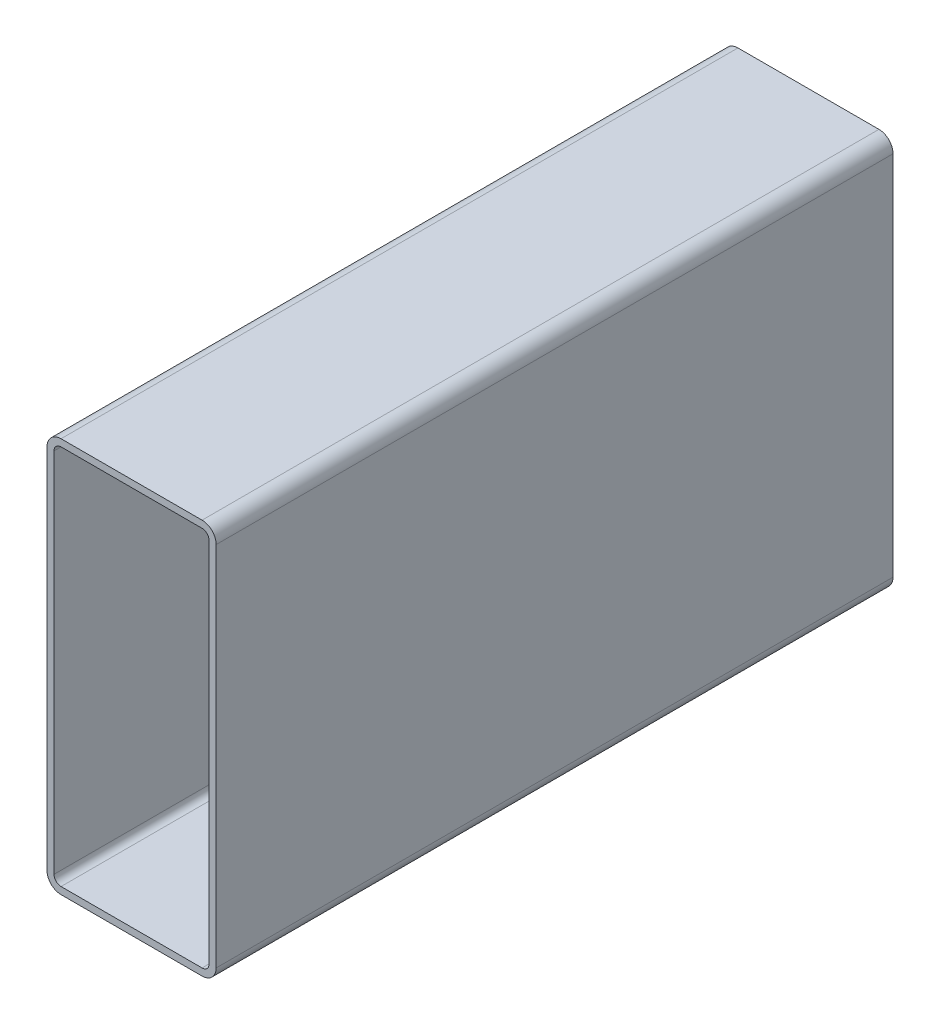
ISO-10303-21;
HEADER;
FILE_DESCRIPTION(('STEP AP214'),'2;1');
FILE_NAME('part.step','',(''),(''),'','','');
FILE_SCHEMA(('AUTOMOTIVE_DESIGN { 1 0 10303 214 1 1 1 1 }'));
ENDSEC;
DATA;
#1=APPLICATION_CONTEXT('core data for automotive mechanical design processes');
#2=APPLICATION_PROTOCOL_DEFINITION('international standard','automotive_design',2000,#1);
#3=PRODUCT_CONTEXT('',#1,'mechanical');
#4=PRODUCT('Part','Part','',(#3));
#5=PRODUCT_RELATED_PRODUCT_CATEGORY('part','',(#4));
#6=PRODUCT_DEFINITION_FORMATION('','',#4);
#7=PRODUCT_DEFINITION_CONTEXT('part definition',#1,'design');
#8=PRODUCT_DEFINITION('design','',#6,#7);
#9=PRODUCT_DEFINITION_SHAPE('','',#8);
#10=(LENGTH_UNIT() NAMED_UNIT(*) SI_UNIT(.MILLI.,.METRE.));
#11=(NAMED_UNIT(*) PLANE_ANGLE_UNIT() SI_UNIT($,.RADIAN.));
#12=(NAMED_UNIT(*) SI_UNIT($,.STERADIAN.) SOLID_ANGLE_UNIT());
#13=UNCERTAINTY_MEASURE_WITH_UNIT(LENGTH_MEASURE(1.E-05),#10,'distance_accuracy_value','');
#14=(GEOMETRIC_REPRESENTATION_CONTEXT(3) GLOBAL_UNCERTAINTY_ASSIGNED_CONTEXT((#13)) GLOBAL_UNIT_ASSIGNED_CONTEXT((#10,
#11,#12)) REPRESENTATION_CONTEXT('',''));
#15=CARTESIAN_POINT('',(0.,0.,0.));
#16=DIRECTION('',(0.,0.,1.));
#17=DIRECTION('',(1.,0.,0.));
#18=AXIS2_PLACEMENT_3D('',#15,#16,#17);
#19=CARTESIAN_POINT('',(8.83911603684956,173.439039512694,304.8));
#20=DIRECTION('',(0.,0.,1.));
#21=DIRECTION('',(1.,0.,0.));
#22=AXIS2_PLACEMENT_3D('',#19,#20,#21);
#23=PLANE('',#22);
#24=CARTESIAN_POINT('',(8.83911603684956,173.439039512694,304.8));
#25=DIRECTION('',(0.,0.,1.));
#26=DIRECTION('',(1.,0.,0.));
#27=AXIS2_PLACEMENT_3D('',#24,#25,#26);
#28=CIRCLE('',#27,6.35);
#29=CARTESIAN_POINT('',(8.83911603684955,179.789039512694,304.8));
#30=VERTEX_POINT('',#29);
#31=CARTESIAN_POINT('',(2.48911603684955,173.439039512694,304.8));
#32=VERTEX_POINT('',#31);
#33=EDGE_CURVE('E211',#30,#32,#28,.T.);
#34=ORIENTED_EDGE('',*,*,#33,.T.);
#35=DIRECTION('',(0.,-1.,0.));
#36=VECTOR('',#35,1.);
#37=CARTESIAN_POINT('',(2.48911603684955,8.33903951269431,304.8));
#38=LINE('',#37,#36);
#39=CARTESIAN_POINT('',(2.48911603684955,8.33903951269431,304.8));
#40=VERTEX_POINT('',#39);
#41=EDGE_CURVE('E214',#32,#40,#38,.T.);
#42=ORIENTED_EDGE('',*,*,#41,.T.);
#43=CARTESIAN_POINT('',(8.83911603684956,8.33903951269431,304.8));
#44=DIRECTION('',(0.,0.,1.));
#45=DIRECTION('',(1.,0.,0.));
#46=AXIS2_PLACEMENT_3D('',#43,#44,#45);
#47=CIRCLE('',#46,6.35);
#48=CARTESIAN_POINT('',(8.83911603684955,1.98903951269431,304.8));
#49=VERTEX_POINT('',#48);
#50=EDGE_CURVE('E217',#40,#49,#47,.T.);
#51=ORIENTED_EDGE('',*,*,#50,.T.);
#52=DIRECTION('',(1.,0.,0.));
#53=VECTOR('',#52,1.);
#54=CARTESIAN_POINT('',(72.3391160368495,1.98903951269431,304.8));
#55=LINE('',#54,#53);
#56=CARTESIAN_POINT('',(72.3391160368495,1.98903951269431,304.8));
#57=VERTEX_POINT('',#56);
#58=EDGE_CURVE('E219',#49,#57,#55,.T.);
#59=ORIENTED_EDGE('',*,*,#58,.T.);
#60=CARTESIAN_POINT('',(72.3391160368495,8.3390395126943,304.8));
#61=DIRECTION('',(0.,0.,1.));
#62=DIRECTION('',(1.,0.,0.));
#63=AXIS2_PLACEMENT_3D('',#60,#61,#62);
#64=CIRCLE('',#63,6.34999999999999);
#65=CARTESIAN_POINT('',(78.6891160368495,8.33903951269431,304.8));
#66=VERTEX_POINT('',#65);
#67=EDGE_CURVE('E221',#57,#66,#64,.T.);
#68=ORIENTED_EDGE('',*,*,#67,.T.);
#69=DIRECTION('',(0.,1.,0.));
#70=VECTOR('',#69,1.);
#71=CARTESIAN_POINT('',(78.6891160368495,173.439039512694,304.8));
#72=LINE('',#71,#70);
#73=CARTESIAN_POINT('',(78.6891160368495,173.439039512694,304.8));
#74=VERTEX_POINT('',#73);
#75=EDGE_CURVE('E223',#66,#74,#72,.T.);
#76=ORIENTED_EDGE('',*,*,#75,.T.);
#77=CARTESIAN_POINT('',(72.3391160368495,173.439039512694,304.8));
#78=DIRECTION('',(0.,0.,1.));
#79=DIRECTION('',(1.,0.,0.));
#80=AXIS2_PLACEMENT_3D('',#77,#78,#79);
#81=CIRCLE('',#80,6.34999999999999);
#82=CARTESIAN_POINT('',(72.3391160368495,179.789039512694,304.8));
#83=VERTEX_POINT('',#82);
#84=EDGE_CURVE('E225',#74,#83,#81,.T.);
#85=ORIENTED_EDGE('',*,*,#84,.T.);
#86=DIRECTION('',(-1.,0.,0.));
#87=VECTOR('',#86,1.);
#88=CARTESIAN_POINT('',(8.83911603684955,179.789039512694,304.8));
#89=LINE('',#88,#87);
#90=EDGE_CURVE('E227',#83,#30,#89,.T.);
#91=ORIENTED_EDGE('',*,*,#90,.T.);
#92=EDGE_LOOP('',(#34,#42,#51,#59,#68,#76,#85,#91));
#93=FACE_BOUND('',#92,.T.);
#94=DIRECTION('',(0.,-1.,0.));
#95=VECTOR('',#94,1.);
#96=CARTESIAN_POINT('',(5.66411603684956,8.33903951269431,304.8));
#97=LINE('',#96,#95);
#98=CARTESIAN_POINT('',(5.66411603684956,173.439039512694,304.8));
#99=VERTEX_POINT('',#98);
#100=CARTESIAN_POINT('',(5.66411603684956,8.33903951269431,304.8));
#101=VERTEX_POINT('',#100);
#102=EDGE_CURVE('E154',#99,#101,#97,.T.);
#103=ORIENTED_EDGE('',*,*,#102,.F.);
#104=CARTESIAN_POINT('',(8.83911603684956,173.439039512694,304.8));
#105=DIRECTION('',(0.,0.,1.));
#106=DIRECTION('',(1.,0.,0.));
#107=AXIS2_PLACEMENT_3D('',#104,#105,#106);
#108=CIRCLE('',#107,3.17500000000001);
#109=CARTESIAN_POINT('',(8.83911603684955,176.614039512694,304.8));
#110=VERTEX_POINT('',#109);
#111=EDGE_CURVE('E146',#110,#99,#108,.T.);
#112=ORIENTED_EDGE('',*,*,#111,.F.);
#113=DIRECTION('',(-1.,0.,0.));
#114=VECTOR('',#113,1.);
#115=CARTESIAN_POINT('',(8.83911603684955,176.614039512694,304.8));
#116=LINE('',#115,#114);
#117=CARTESIAN_POINT('',(72.3391160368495,176.614039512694,304.8));
#118=VERTEX_POINT('',#117);
#119=EDGE_CURVE('E179',#118,#110,#116,.T.);
#120=ORIENTED_EDGE('',*,*,#119,.F.);
#121=CARTESIAN_POINT('',(72.3391160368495,173.439039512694,304.8));
#122=DIRECTION('',(0.,0.,1.));
#123=DIRECTION('',(1.,0.,0.));
#124=AXIS2_PLACEMENT_3D('',#121,#122,#123);
#125=CIRCLE('',#124,3.17500000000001);
#126=CARTESIAN_POINT('',(75.5141160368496,173.439039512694,304.8));
#127=VERTEX_POINT('',#126);
#128=EDGE_CURVE('E177',#127,#118,#125,.T.);
#129=ORIENTED_EDGE('',*,*,#128,.F.);
#130=DIRECTION('',(0.,1.,0.));
#131=VECTOR('',#130,1.);
#132=CARTESIAN_POINT('',(75.5141160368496,173.439039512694,304.8));
#133=LINE('',#132,#131);
#134=CARTESIAN_POINT('',(75.5141160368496,8.33903951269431,304.8));
#135=VERTEX_POINT('',#134);
#136=EDGE_CURVE('E175',#135,#127,#133,.T.);
#137=ORIENTED_EDGE('',*,*,#136,.F.);
#138=CARTESIAN_POINT('',(72.3391160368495,8.3390395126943,304.8));
#139=DIRECTION('',(0.,0.,1.));
#140=DIRECTION('',(1.,0.,0.));
#141=AXIS2_PLACEMENT_3D('',#138,#139,#140);
#142=CIRCLE('',#141,3.175);
#143=CARTESIAN_POINT('',(72.3391160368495,5.1640395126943,304.8));
#144=VERTEX_POINT('',#143);
#145=EDGE_CURVE('E173',#144,#135,#142,.T.);
#146=ORIENTED_EDGE('',*,*,#145,.F.);
#147=DIRECTION('',(1.,0.,0.));
#148=VECTOR('',#147,1.);
#149=CARTESIAN_POINT('',(72.3391160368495,5.16403951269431,304.8));
#150=LINE('',#149,#148);
#151=CARTESIAN_POINT('',(8.83911603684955,5.16403951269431,304.8));
#152=VERTEX_POINT('',#151);
#153=EDGE_CURVE('E169',#152,#144,#150,.T.);
#154=ORIENTED_EDGE('',*,*,#153,.F.);
#155=CARTESIAN_POINT('',(8.83911603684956,8.33903951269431,304.8));
#156=DIRECTION('',(0.,0.,1.));
#157=DIRECTION('',(1.,0.,0.));
#158=AXIS2_PLACEMENT_3D('',#155,#156,#157);
#159=CIRCLE('',#158,3.175);
#160=EDGE_CURVE('E167',#101,#152,#159,.T.);
#161=ORIENTED_EDGE('',*,*,#160,.F.);
#162=EDGE_LOOP('',(#103,#112,#120,#129,#137,#146,#154,#161));
#163=FACE_BOUND('',#162,.T.);
#164=ADVANCED_FACE('F33',(#93,#163),#23,.T.);
#165=CARTESIAN_POINT('',(8.83911603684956,173.439039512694,0.));
#166=DIRECTION('',(0.,0.,1.));
#167=DIRECTION('',(1.,0.,0.));
#168=AXIS2_PLACEMENT_3D('',#165,#166,#167);
#169=PLANE('',#168);
#170=CARTESIAN_POINT('',(8.83911603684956,173.439039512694,0.));
#171=DIRECTION('',(0.,0.,1.));
#172=DIRECTION('',(1.,0.,0.));
#173=AXIS2_PLACEMENT_3D('',#170,#171,#172);
#174=CIRCLE('',#173,6.35);
#175=CARTESIAN_POINT('',(8.83911603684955,179.789039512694,0.));
#176=VERTEX_POINT('',#175);
#177=CARTESIAN_POINT('',(2.48911603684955,173.439039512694,0.));
#178=VERTEX_POINT('',#177);
#179=EDGE_CURVE('E162',#176,#178,#174,.T.);
#180=ORIENTED_EDGE('',*,*,#179,.F.);
#181=DIRECTION('',(-1.,0.,0.));
#182=VECTOR('',#181,1.);
#183=CARTESIAN_POINT('',(8.83911603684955,179.789039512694,0.));
#184=LINE('',#183,#182);
#185=CARTESIAN_POINT('',(72.3391160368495,179.789039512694,0.));
#186=VERTEX_POINT('',#185);
#187=EDGE_CURVE('E215',#186,#176,#184,.T.);
#188=ORIENTED_EDGE('',*,*,#187,.F.);
#189=CARTESIAN_POINT('',(72.3391160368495,173.439039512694,0.));
#190=DIRECTION('',(0.,0.,1.));
#191=DIRECTION('',(1.,0.,0.));
#192=AXIS2_PLACEMENT_3D('',#189,#190,#191);
#193=CIRCLE('',#192,6.34999999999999);
#194=CARTESIAN_POINT('',(78.6891160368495,173.439039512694,0.));
#195=VERTEX_POINT('',#194);
#196=EDGE_CURVE('E242',#195,#186,#193,.T.);
#197=ORIENTED_EDGE('',*,*,#196,.F.);
#198=DIRECTION('',(0.,1.,0.));
#199=VECTOR('',#198,1.);
#200=CARTESIAN_POINT('',(78.6891160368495,173.439039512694,0.));
#201=LINE('',#200,#199);
#202=CARTESIAN_POINT('',(78.6891160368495,8.33903951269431,0.));
#203=VERTEX_POINT('',#202);
#204=EDGE_CURVE('E240',#203,#195,#201,.T.);
#205=ORIENTED_EDGE('',*,*,#204,.F.);
#206=CARTESIAN_POINT('',(72.3391160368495,8.3390395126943,0.));
#207=DIRECTION('',(0.,0.,1.));
#208=DIRECTION('',(1.,0.,0.));
#209=AXIS2_PLACEMENT_3D('',#206,#207,#208);
#210=CIRCLE('',#209,6.34999999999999);
#211=CARTESIAN_POINT('',(72.3391160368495,1.98903951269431,0.));
#212=VERTEX_POINT('',#211);
#213=EDGE_CURVE('E238',#212,#203,#210,.T.);
#214=ORIENTED_EDGE('',*,*,#213,.F.);
#215=DIRECTION('',(1.,0.,0.));
#216=VECTOR('',#215,1.);
#217=CARTESIAN_POINT('',(72.3391160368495,1.98903951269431,0.));
#218=LINE('',#217,#216);
#219=CARTESIAN_POINT('',(8.83911603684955,1.98903951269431,0.));
#220=VERTEX_POINT('',#219);
#221=EDGE_CURVE('E236',#220,#212,#218,.T.);
#222=ORIENTED_EDGE('',*,*,#221,.F.);
#223=CARTESIAN_POINT('',(8.83911603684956,8.33903951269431,0.));
#224=DIRECTION('',(0.,0.,1.));
#225=DIRECTION('',(1.,0.,0.));
#226=AXIS2_PLACEMENT_3D('',#223,#224,#225);
#227=CIRCLE('',#226,6.35);
#228=CARTESIAN_POINT('',(2.48911603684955,8.33903951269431,0.));
#229=VERTEX_POINT('',#228);
#230=EDGE_CURVE('E234',#229,#220,#227,.T.);
#231=ORIENTED_EDGE('',*,*,#230,.F.);
#232=DIRECTION('',(0.,-1.,0.));
#233=VECTOR('',#232,1.);
#234=CARTESIAN_POINT('',(2.48911603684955,8.33903951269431,0.));
#235=LINE('',#234,#233);
#236=EDGE_CURVE('E232',#178,#229,#235,.T.);
#237=ORIENTED_EDGE('',*,*,#236,.F.);
#238=EDGE_LOOP('',(#180,#188,#197,#205,#214,#222,#231,#237));
#239=FACE_BOUND('',#238,.T.);
#240=CARTESIAN_POINT('',(8.83911603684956,173.439039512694,0.));
#241=DIRECTION('',(0.,0.,1.));
#242=DIRECTION('',(1.,0.,0.));
#243=AXIS2_PLACEMENT_3D('',#240,#241,#242);
#244=CIRCLE('',#243,3.17500000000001);
#245=CARTESIAN_POINT('',(8.83911603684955,176.614039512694,0.));
#246=VERTEX_POINT('',#245);
#247=CARTESIAN_POINT('',(5.66411603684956,173.439039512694,0.));
#248=VERTEX_POINT('',#247);
#249=EDGE_CURVE('E56',#246,#248,#244,.T.);
#250=ORIENTED_EDGE('',*,*,#249,.T.);
#251=DIRECTION('',(0.,-1.,0.));
#252=VECTOR('',#251,1.);
#253=CARTESIAN_POINT('',(5.66411603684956,8.33903951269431,0.));
#254=LINE('',#253,#252);
#255=CARTESIAN_POINT('',(5.66411603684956,8.33903951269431,0.));
#256=VERTEX_POINT('',#255);
#257=EDGE_CURVE('E161',#248,#256,#254,.T.);
#258=ORIENTED_EDGE('',*,*,#257,.T.);
#259=CARTESIAN_POINT('',(8.83911603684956,8.33903951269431,0.));
#260=DIRECTION('',(0.,0.,1.));
#261=DIRECTION('',(1.,0.,0.));
#262=AXIS2_PLACEMENT_3D('',#259,#260,#261);
#263=CIRCLE('',#262,3.175);
#264=CARTESIAN_POINT('',(8.83911603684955,5.16403951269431,0.));
#265=VERTEX_POINT('',#264);
#266=EDGE_CURVE('E183',#256,#265,#263,.T.);
#267=ORIENTED_EDGE('',*,*,#266,.T.);
#268=DIRECTION('',(1.,0.,0.));
#269=VECTOR('',#268,1.);
#270=CARTESIAN_POINT('',(72.3391160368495,5.16403951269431,0.));
#271=LINE('',#270,#269);
#272=CARTESIAN_POINT('',(72.3391160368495,5.1640395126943,0.));
#273=VERTEX_POINT('',#272);
#274=EDGE_CURVE('E186',#265,#273,#271,.T.);
#275=ORIENTED_EDGE('',*,*,#274,.T.);
#276=CARTESIAN_POINT('',(72.3391160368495,8.3390395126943,0.));
#277=DIRECTION('',(0.,0.,1.));
#278=DIRECTION('',(1.,0.,0.));
#279=AXIS2_PLACEMENT_3D('',#276,#277,#278);
#280=CIRCLE('',#279,3.175);
#281=CARTESIAN_POINT('',(75.5141160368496,8.33903951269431,0.));
#282=VERTEX_POINT('',#281);
#283=EDGE_CURVE('E189',#273,#282,#280,.T.);
#284=ORIENTED_EDGE('',*,*,#283,.T.);
#285=DIRECTION('',(0.,1.,0.));
#286=VECTOR('',#285,1.);
#287=CARTESIAN_POINT('',(75.5141160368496,173.439039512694,0.));
#288=LINE('',#287,#286);
#289=CARTESIAN_POINT('',(75.5141160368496,173.439039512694,0.));
#290=VERTEX_POINT('',#289);
#291=EDGE_CURVE('E192',#282,#290,#288,.T.);
#292=ORIENTED_EDGE('',*,*,#291,.T.);
#293=CARTESIAN_POINT('',(72.3391160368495,173.439039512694,0.));
#294=DIRECTION('',(0.,0.,1.));
#295=DIRECTION('',(1.,0.,0.));
#296=AXIS2_PLACEMENT_3D('',#293,#294,#295);
#297=CIRCLE('',#296,3.17500000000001);
#298=CARTESIAN_POINT('',(72.3391160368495,176.614039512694,0.));
#299=VERTEX_POINT('',#298);
#300=EDGE_CURVE('E195',#290,#299,#297,.T.);
#301=ORIENTED_EDGE('',*,*,#300,.T.);
#302=DIRECTION('',(-1.,0.,0.));
#303=VECTOR('',#302,1.);
#304=CARTESIAN_POINT('',(8.83911603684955,176.614039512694,0.));
#305=LINE('',#304,#303);
#306=EDGE_CURVE('E155',#299,#246,#305,.T.);
#307=ORIENTED_EDGE('',*,*,#306,.T.);
#308=EDGE_LOOP('',(#250,#258,#267,#275,#284,#292,#301,#307));
#309=FACE_BOUND('',#308,.T.);
#310=ADVANCED_FACE('F272',(#239,#309),#169,.F.);
#311=CARTESIAN_POINT('',(8.83911603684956,173.439039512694,304.8));
#312=DIRECTION('',(0.,0.,-1.));
#313=DIRECTION('',(-1.,0.,0.));
#314=AXIS2_PLACEMENT_3D('',#311,#312,#313);
#315=CYLINDRICAL_SURFACE('',#314,6.35);
#316=ORIENTED_EDGE('',*,*,#179,.T.);
#317=DIRECTION('',(0.,0.,-1.));
#318=VECTOR('',#317,1.);
#319=CARTESIAN_POINT('',(2.48911603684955,173.439039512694,304.8));
#320=LINE('',#319,#318);
#321=EDGE_CURVE('E11',#32,#178,#320,.T.);
#322=ORIENTED_EDGE('',*,*,#321,.F.);
#323=ORIENTED_EDGE('',*,*,#33,.F.);
#324=DIRECTION('',(0.,0.,-1.));
#325=VECTOR('',#324,1.);
#326=CARTESIAN_POINT('',(8.83911603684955,179.789039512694,304.8));
#327=LINE('',#326,#325);
#328=EDGE_CURVE('E229',#30,#176,#327,.T.);
#329=ORIENTED_EDGE('',*,*,#328,.T.);
#330=EDGE_LOOP('',(#316,#322,#323,#329));
#331=FACE_BOUND('',#330,.T.);
#332=ADVANCED_FACE('F35',(#331),#315,.T.);
#333=CARTESIAN_POINT('',(2.48911603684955,8.33903951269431,304.8));
#334=DIRECTION('',(1.,0.,0.));
#335=DIRECTION('',(0.,0.,-1.));
#336=AXIS2_PLACEMENT_3D('',#333,#334,#335);
#337=PLANE('',#336);
#338=ORIENTED_EDGE('',*,*,#236,.T.);
#339=DIRECTION('',(0.,0.,-1.));
#340=VECTOR('',#339,1.);
#341=CARTESIAN_POINT('',(2.48911603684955,8.33903951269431,304.8));
#342=LINE('',#341,#340);
#343=EDGE_CURVE('E41',#40,#229,#342,.T.);
#344=ORIENTED_EDGE('',*,*,#343,.F.);
#345=ORIENTED_EDGE('',*,*,#41,.F.);
#346=ORIENTED_EDGE('',*,*,#321,.T.);
#347=EDGE_LOOP('',(#338,#344,#345,#346));
#348=FACE_BOUND('',#347,.T.);
#349=ADVANCED_FACE('F289',(#348),#337,.F.);
#350=CARTESIAN_POINT('',(8.83911603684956,8.33903951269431,304.8));
#351=DIRECTION('',(0.,0.,-1.));
#352=DIRECTION('',(-1.,0.,0.));
#353=AXIS2_PLACEMENT_3D('',#350,#351,#352);
#354=CYLINDRICAL_SURFACE('',#353,6.35);
#355=ORIENTED_EDGE('',*,*,#230,.T.);
#356=DIRECTION('',(0.,0.,-1.));
#357=VECTOR('',#356,1.);
#358=CARTESIAN_POINT('',(8.83911603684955,1.98903951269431,304.8));
#359=LINE('',#358,#357);
#360=EDGE_CURVE('E259',#49,#220,#359,.T.);
#361=ORIENTED_EDGE('',*,*,#360,.F.);
#362=ORIENTED_EDGE('',*,*,#50,.F.);
#363=ORIENTED_EDGE('',*,*,#343,.T.);
#364=EDGE_LOOP('',(#355,#361,#362,#363));
#365=FACE_BOUND('',#364,.T.);
#366=ADVANCED_FACE('F266',(#365),#354,.T.);
#367=CARTESIAN_POINT('',(72.3391160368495,1.98903951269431,304.8));
#368=DIRECTION('',(0.,1.,0.));
#369=DIRECTION('',(0.,0.,1.));
#370=AXIS2_PLACEMENT_3D('',#367,#368,#369);
#371=PLANE('',#370);
#372=ORIENTED_EDGE('',*,*,#221,.T.);
#373=DIRECTION('',(0.,0.,-1.));
#374=VECTOR('',#373,1.);
#375=CARTESIAN_POINT('',(72.3391160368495,1.98903951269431,304.8));
#376=LINE('',#375,#374);
#377=EDGE_CURVE('E256',#57,#212,#376,.T.);
#378=ORIENTED_EDGE('',*,*,#377,.F.);
#379=ORIENTED_EDGE('',*,*,#58,.F.);
#380=ORIENTED_EDGE('',*,*,#360,.T.);
#381=EDGE_LOOP('',(#372,#378,#379,#380));
#382=FACE_BOUND('',#381,.T.);
#383=ADVANCED_FACE('F278',(#382),#371,.F.);
#384=CARTESIAN_POINT('',(72.3391160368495,8.3390395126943,304.8));
#385=DIRECTION('',(0.,0.,-1.));
#386=DIRECTION('',(-1.,0.,0.));
#387=AXIS2_PLACEMENT_3D('',#384,#385,#386);
#388=CYLINDRICAL_SURFACE('',#387,6.34999999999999);
#389=ORIENTED_EDGE('',*,*,#213,.T.);
#390=DIRECTION('',(0.,0.,-1.));
#391=VECTOR('',#390,1.);
#392=CARTESIAN_POINT('',(78.6891160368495,8.33903951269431,304.8));
#393=LINE('',#392,#391);
#394=EDGE_CURVE('E253',#66,#203,#393,.T.);
#395=ORIENTED_EDGE('',*,*,#394,.F.);
#396=ORIENTED_EDGE('',*,*,#67,.F.);
#397=ORIENTED_EDGE('',*,*,#377,.T.);
#398=EDGE_LOOP('',(#389,#395,#396,#397));
#399=FACE_BOUND('',#398,.T.);
#400=ADVANCED_FACE('F282',(#399),#388,.T.);
#401=CARTESIAN_POINT('',(78.6891160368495,173.439039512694,304.8));
#402=DIRECTION('',(-1.,0.,0.));
#403=DIRECTION('',(0.,0.,1.));
#404=AXIS2_PLACEMENT_3D('',#401,#402,#403);
#405=PLANE('',#404);
#406=ORIENTED_EDGE('',*,*,#204,.T.);
#407=DIRECTION('',(0.,0.,-1.));
#408=VECTOR('',#407,1.);
#409=CARTESIAN_POINT('',(78.6891160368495,173.439039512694,304.8));
#410=LINE('',#409,#408);
#411=EDGE_CURVE('E250',#74,#195,#410,.T.);
#412=ORIENTED_EDGE('',*,*,#411,.F.);
#413=ORIENTED_EDGE('',*,*,#75,.F.);
#414=ORIENTED_EDGE('',*,*,#394,.T.);
#415=EDGE_LOOP('',(#406,#412,#413,#414));
#416=FACE_BOUND('',#415,.T.);
#417=ADVANCED_FACE('F302',(#416),#405,.F.);
#418=CARTESIAN_POINT('',(72.3391160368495,173.439039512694,304.8));
#419=DIRECTION('',(0.,0.,-1.));
#420=DIRECTION('',(-1.,0.,0.));
#421=AXIS2_PLACEMENT_3D('',#418,#419,#420);
#422=CYLINDRICAL_SURFACE('',#421,6.34999999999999);
#423=ORIENTED_EDGE('',*,*,#196,.T.);
#424=DIRECTION('',(0.,0.,-1.));
#425=VECTOR('',#424,1.);
#426=CARTESIAN_POINT('',(72.3391160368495,179.789039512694,304.8));
#427=LINE('',#426,#425);
#428=EDGE_CURVE('E247',#83,#186,#427,.T.);
#429=ORIENTED_EDGE('',*,*,#428,.F.);
#430=ORIENTED_EDGE('',*,*,#84,.F.);
#431=ORIENTED_EDGE('',*,*,#411,.T.);
#432=EDGE_LOOP('',(#423,#429,#430,#431));
#433=FACE_BOUND('',#432,.T.);
#434=ADVANCED_FACE('F300',(#433),#422,.T.);
#435=CARTESIAN_POINT('',(8.83911603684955,179.789039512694,304.8));
#436=DIRECTION('',(0.,-1.,0.));
#437=DIRECTION('',(0.,0.,-1.));
#438=AXIS2_PLACEMENT_3D('',#435,#436,#437);
#439=PLANE('',#438);
#440=ORIENTED_EDGE('',*,*,#187,.T.);
#441=ORIENTED_EDGE('',*,*,#328,.F.);
#442=ORIENTED_EDGE('',*,*,#90,.F.);
#443=ORIENTED_EDGE('',*,*,#428,.T.);
#444=EDGE_LOOP('',(#440,#441,#442,#443));
#445=FACE_BOUND('',#444,.T.);
#446=ADVANCED_FACE('F295',(#445),#439,.F.);
#447=CARTESIAN_POINT('',(8.83911603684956,173.439039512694,304.8));
#448=DIRECTION('',(0.,0.,-1.));
#449=DIRECTION('',(-1.,0.,0.));
#450=AXIS2_PLACEMENT_3D('',#447,#448,#449);
#451=CYLINDRICAL_SURFACE('',#450,3.17500000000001);
#452=ORIENTED_EDGE('',*,*,#249,.F.);
#453=DIRECTION('',(0.,0.,-1.));
#454=VECTOR('',#453,1.);
#455=CARTESIAN_POINT('',(8.83911603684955,176.614039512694,304.8));
#456=LINE('',#455,#454);
#457=EDGE_CURVE('E150',#110,#246,#456,.T.);
#458=ORIENTED_EDGE('',*,*,#457,.F.);
#459=ORIENTED_EDGE('',*,*,#111,.T.);
#460=DIRECTION('',(0.,0.,-1.));
#461=VECTOR('',#460,1.);
#462=CARTESIAN_POINT('',(5.66411603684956,173.439039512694,304.8));
#463=LINE('',#462,#461);
#464=EDGE_CURVE('E149',#99,#248,#463,.T.);
#465=ORIENTED_EDGE('',*,*,#464,.T.);
#466=EDGE_LOOP('',(#452,#458,#459,#465));
#467=FACE_BOUND('',#466,.T.);
#468=ADVANCED_FACE('F148',(#467),#451,.F.);
#469=CARTESIAN_POINT('',(5.66411603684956,8.33903951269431,304.8));
#470=DIRECTION('',(1.,0.,0.));
#471=DIRECTION('',(0.,0.,-1.));
#472=AXIS2_PLACEMENT_3D('',#469,#470,#471);
#473=PLANE('',#472);
#474=ORIENTED_EDGE('',*,*,#257,.F.);
#475=ORIENTED_EDGE('',*,*,#464,.F.);
#476=ORIENTED_EDGE('',*,*,#102,.T.);
#477=DIRECTION('',(0.,0.,-1.));
#478=VECTOR('',#477,1.);
#479=CARTESIAN_POINT('',(5.66411603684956,8.33903951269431,304.8));
#480=LINE('',#479,#478);
#481=EDGE_CURVE('E163',#101,#256,#480,.T.);
#482=ORIENTED_EDGE('',*,*,#481,.T.);
#483=EDGE_LOOP('',(#474,#475,#476,#482));
#484=FACE_BOUND('',#483,.T.);
#485=ADVANCED_FACE('F158',(#484),#473,.T.);
#486=CARTESIAN_POINT('',(8.83911603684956,8.33903951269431,304.8));
#487=DIRECTION('',(0.,0.,-1.));
#488=DIRECTION('',(-1.,0.,0.));
#489=AXIS2_PLACEMENT_3D('',#486,#487,#488);
#490=CYLINDRICAL_SURFACE('',#489,3.175);
#491=ORIENTED_EDGE('',*,*,#266,.F.);
#492=ORIENTED_EDGE('',*,*,#481,.F.);
#493=ORIENTED_EDGE('',*,*,#160,.T.);
#494=DIRECTION('',(0.,0.,-1.));
#495=VECTOR('',#494,1.);
#496=CARTESIAN_POINT('',(8.83911603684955,5.16403951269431,304.8));
#497=LINE('',#496,#495);
#498=EDGE_CURVE('E208',#152,#265,#497,.T.);
#499=ORIENTED_EDGE('',*,*,#498,.T.);
#500=EDGE_LOOP('',(#491,#492,#493,#499));
#501=FACE_BOUND('',#500,.T.);
#502=ADVANCED_FACE('F327',(#501),#490,.F.);
#503=CARTESIAN_POINT('',(72.3391160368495,5.16403951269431,304.8));
#504=DIRECTION('',(0.,1.,0.));
#505=DIRECTION('',(0.,0.,1.));
#506=AXIS2_PLACEMENT_3D('',#503,#504,#505);
#507=PLANE('',#506);
#508=ORIENTED_EDGE('',*,*,#274,.F.);
#509=ORIENTED_EDGE('',*,*,#498,.F.);
#510=ORIENTED_EDGE('',*,*,#153,.T.);
#511=DIRECTION('',(0.,0.,-1.));
#512=VECTOR('',#511,1.);
#513=CARTESIAN_POINT('',(72.3391160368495,5.1640395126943,304.8));
#514=LINE('',#513,#512);
#515=EDGE_CURVE('E206',#144,#273,#514,.T.);
#516=ORIENTED_EDGE('',*,*,#515,.T.);
#517=EDGE_LOOP('',(#508,#509,#510,#516));
#518=FACE_BOUND('',#517,.T.);
#519=ADVANCED_FACE('F331',(#518),#507,.T.);
#520=CARTESIAN_POINT('',(72.3391160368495,8.3390395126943,304.8));
#521=DIRECTION('',(0.,0.,-1.));
#522=DIRECTION('',(-1.,0.,0.));
#523=AXIS2_PLACEMENT_3D('',#520,#521,#522);
#524=CYLINDRICAL_SURFACE('',#523,3.175);
#525=ORIENTED_EDGE('',*,*,#283,.F.);
#526=ORIENTED_EDGE('',*,*,#515,.F.);
#527=ORIENTED_EDGE('',*,*,#145,.T.);
#528=DIRECTION('',(0.,0.,-1.));
#529=VECTOR('',#528,1.);
#530=CARTESIAN_POINT('',(75.5141160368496,8.33903951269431,304.8));
#531=LINE('',#530,#529);
#532=EDGE_CURVE('E204',#135,#282,#531,.T.);
#533=ORIENTED_EDGE('',*,*,#532,.T.);
#534=EDGE_LOOP('',(#525,#526,#527,#533));
#535=FACE_BOUND('',#534,.T.);
#536=ADVANCED_FACE('F337',(#535),#524,.F.);
#537=CARTESIAN_POINT('',(75.5141160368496,173.439039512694,304.8));
#538=DIRECTION('',(-1.,0.,0.));
#539=DIRECTION('',(0.,0.,1.));
#540=AXIS2_PLACEMENT_3D('',#537,#538,#539);
#541=PLANE('',#540);
#542=ORIENTED_EDGE('',*,*,#291,.F.);
#543=ORIENTED_EDGE('',*,*,#532,.F.);
#544=ORIENTED_EDGE('',*,*,#136,.T.);
#545=DIRECTION('',(0.,0.,-1.));
#546=VECTOR('',#545,1.);
#547=CARTESIAN_POINT('',(75.5141160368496,173.439039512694,304.8));
#548=LINE('',#547,#546);
#549=EDGE_CURVE('E202',#127,#290,#548,.T.);
#550=ORIENTED_EDGE('',*,*,#549,.T.);
#551=EDGE_LOOP('',(#542,#543,#544,#550));
#552=FACE_BOUND('',#551,.T.);
#553=ADVANCED_FACE('F341',(#552),#541,.T.);
#554=CARTESIAN_POINT('',(72.3391160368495,173.439039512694,304.8));
#555=DIRECTION('',(0.,0.,-1.));
#556=DIRECTION('',(-1.,0.,0.));
#557=AXIS2_PLACEMENT_3D('',#554,#555,#556);
#558=CYLINDRICAL_SURFACE('',#557,3.17500000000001);
#559=ORIENTED_EDGE('',*,*,#300,.F.);
#560=ORIENTED_EDGE('',*,*,#549,.F.);
#561=ORIENTED_EDGE('',*,*,#128,.T.);
#562=DIRECTION('',(0.,0.,-1.));
#563=VECTOR('',#562,1.);
#564=CARTESIAN_POINT('',(72.3391160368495,176.614039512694,304.8));
#565=LINE('',#564,#563);
#566=EDGE_CURVE('E48',#118,#299,#565,.T.);
#567=ORIENTED_EDGE('',*,*,#566,.T.);
#568=EDGE_LOOP('',(#559,#560,#561,#567));
#569=FACE_BOUND('',#568,.T.);
#570=ADVANCED_FACE('F345',(#569),#558,.F.);
#571=CARTESIAN_POINT('',(8.83911603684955,176.614039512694,304.8));
#572=DIRECTION('',(0.,-1.,0.));
#573=DIRECTION('',(0.,0.,-1.));
#574=AXIS2_PLACEMENT_3D('',#571,#572,#573);
#575=PLANE('',#574);
#576=ORIENTED_EDGE('',*,*,#306,.F.);
#577=ORIENTED_EDGE('',*,*,#566,.F.);
#578=ORIENTED_EDGE('',*,*,#119,.T.);
#579=ORIENTED_EDGE('',*,*,#457,.T.);
#580=EDGE_LOOP('',(#576,#577,#578,#579));
#581=FACE_BOUND('',#580,.T.);
#582=ADVANCED_FACE('F349',(#581),#575,.T.);
#583=CLOSED_SHELL('',(#164,#310,#332,#349,#366,#383,#400,#417,#434,#446,#468,#485,#502,#519,
#536,#553,#570,#582));
#584=MANIFOLD_SOLID_BREP('B2',#583);
#585=ADVANCED_BREP_SHAPE_REPRESENTATION('',(#18,#584),#14);
#586=SHAPE_DEFINITION_REPRESENTATION(#9,#585);
ENDSEC;
END-ISO-10303-21;
